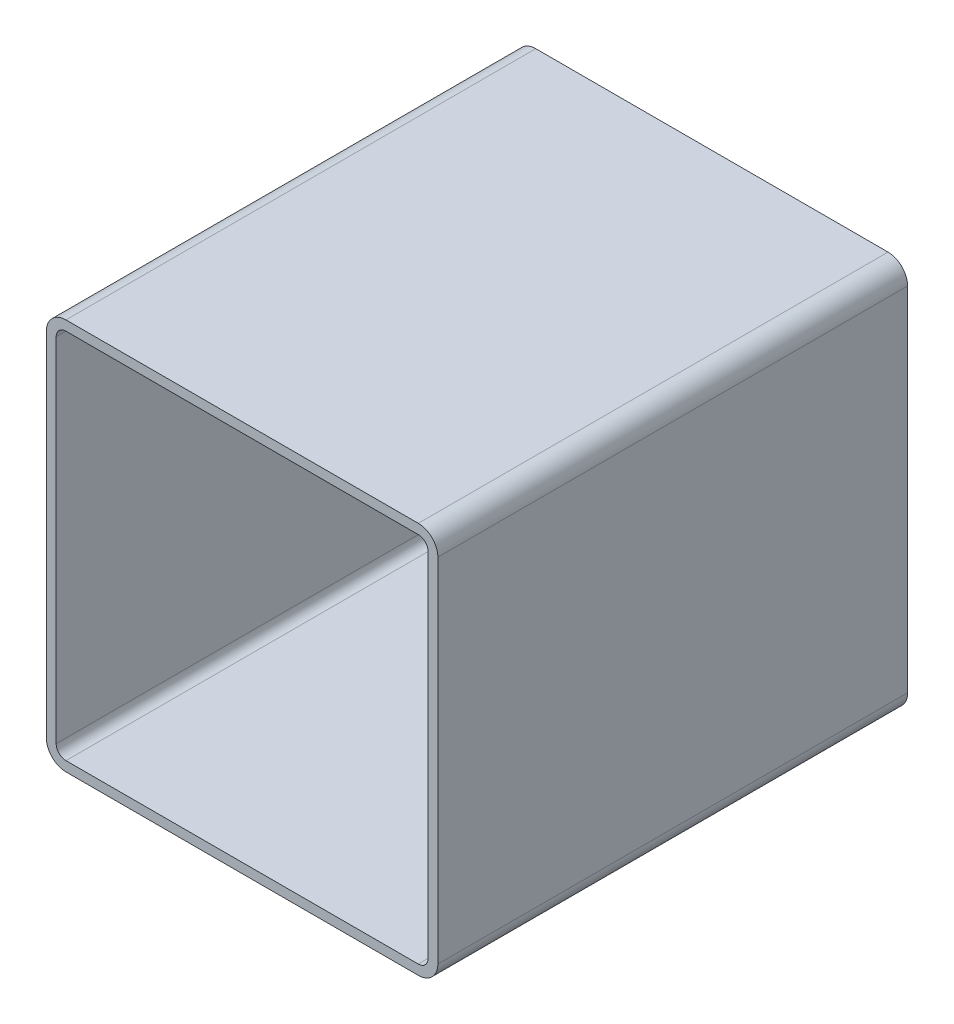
ISO-10303-21;
HEADER;
FILE_DESCRIPTION(('STEP AP214'),'2;1');
FILE_NAME('part.step','',(''),(''),'','','');
FILE_SCHEMA(('AUTOMOTIVE_DESIGN { 1 0 10303 214 1 1 1 1 }'));
ENDSEC;
DATA;
#1=APPLICATION_CONTEXT('core data for automotive mechanical design processes');
#2=APPLICATION_PROTOCOL_DEFINITION('international standard','automotive_design',2000,#1);
#3=PRODUCT_CONTEXT('',#1,'mechanical');
#4=PRODUCT('Part','Part','',(#3));
#5=PRODUCT_RELATED_PRODUCT_CATEGORY('part','',(#4));
#6=PRODUCT_DEFINITION_FORMATION('','',#4);
#7=PRODUCT_DEFINITION_CONTEXT('part definition',#1,'design');
#8=PRODUCT_DEFINITION('design','',#6,#7);
#9=PRODUCT_DEFINITION_SHAPE('','',#8);
#10=(LENGTH_UNIT() NAMED_UNIT(*) SI_UNIT(.MILLI.,.METRE.));
#11=(NAMED_UNIT(*) PLANE_ANGLE_UNIT() SI_UNIT($,.RADIAN.));
#12=(NAMED_UNIT(*) SI_UNIT($,.STERADIAN.) SOLID_ANGLE_UNIT());
#13=UNCERTAINTY_MEASURE_WITH_UNIT(LENGTH_MEASURE(1.E-05),#10,'distance_accuracy_value','');
#14=(GEOMETRIC_REPRESENTATION_CONTEXT(3) GLOBAL_UNCERTAINTY_ASSIGNED_CONTEXT((#13)) GLOBAL_UNIT_ASSIGNED_CONTEXT((#10,
#11,#12)) REPRESENTATION_CONTEXT('',''));
#15=CARTESIAN_POINT('',(0.,0.,0.));
#16=DIRECTION('',(0.,0.,1.));
#17=DIRECTION('',(1.,0.,0.));
#18=AXIS2_PLACEMENT_3D('',#15,#16,#17);
#19=CARTESIAN_POINT('',(15.4345794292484,243.220313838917,304.8));
#20=DIRECTION('',(0.,0.,1.));
#21=DIRECTION('',(1.,0.,0.));
#22=AXIS2_PLACEMENT_3D('',#19,#20,#21);
#23=PLANE('',#22);
#24=CARTESIAN_POINT('',(15.4345794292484,243.220313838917,304.8));
#25=DIRECTION('',(0.,0.,1.));
#26=DIRECTION('',(1.,0.,0.));
#27=AXIS2_PLACEMENT_3D('',#24,#25,#26);
#28=CIRCLE('',#27,12.7);
#29=CARTESIAN_POINT('',(15.4345794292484,255.920313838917,304.8));
#30=VERTEX_POINT('',#29);
#31=CARTESIAN_POINT('',(2.73457942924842,243.220313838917,304.8));
#32=VERTEX_POINT('',#31);
#33=EDGE_CURVE('E211',#30,#32,#28,.T.);
#34=ORIENTED_EDGE('',*,*,#33,.T.);
#35=DIRECTION('',(0.,-1.,0.));
#36=VECTOR('',#35,1.);
#37=CARTESIAN_POINT('',(2.73457942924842,14.6203138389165,304.8));
#38=LINE('',#37,#36);
#39=CARTESIAN_POINT('',(2.73457942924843,14.6203138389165,304.8));
#40=VERTEX_POINT('',#39);
#41=EDGE_CURVE('E214',#32,#40,#38,.T.);
#42=ORIENTED_EDGE('',*,*,#41,.T.);
#43=CARTESIAN_POINT('',(15.4345794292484,14.6203138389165,304.8));
#44=DIRECTION('',(0.,0.,1.));
#45=DIRECTION('',(1.,0.,0.));
#46=AXIS2_PLACEMENT_3D('',#43,#44,#45);
#47=CIRCLE('',#46,12.7);
#48=CARTESIAN_POINT('',(15.4345794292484,1.92031383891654,304.8));
#49=VERTEX_POINT('',#48);
#50=EDGE_CURVE('E217',#40,#49,#47,.T.);
#51=ORIENTED_EDGE('',*,*,#50,.T.);
#52=DIRECTION('',(1.,0.,0.));
#53=VECTOR('',#52,1.);
#54=CARTESIAN_POINT('',(244.034579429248,1.92031383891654,304.8));
#55=LINE('',#54,#53);
#56=CARTESIAN_POINT('',(244.034579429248,1.92031383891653,304.8));
#57=VERTEX_POINT('',#56);
#58=EDGE_CURVE('E219',#49,#57,#55,.T.);
#59=ORIENTED_EDGE('',*,*,#58,.T.);
#60=CARTESIAN_POINT('',(244.034579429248,14.6203138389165,304.8));
#61=DIRECTION('',(0.,0.,1.));
#62=DIRECTION('',(1.,0.,0.));
#63=AXIS2_PLACEMENT_3D('',#60,#61,#62);
#64=CIRCLE('',#63,12.7);
#65=CARTESIAN_POINT('',(256.734579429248,14.6203138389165,304.8));
#66=VERTEX_POINT('',#65);
#67=EDGE_CURVE('E221',#57,#66,#64,.T.);
#68=ORIENTED_EDGE('',*,*,#67,.T.);
#69=DIRECTION('',(0.,1.,0.));
#70=VECTOR('',#69,1.);
#71=CARTESIAN_POINT('',(256.734579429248,243.220313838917,304.8));
#72=LINE('',#71,#70);
#73=CARTESIAN_POINT('',(256.734579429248,243.220313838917,304.8));
#74=VERTEX_POINT('',#73);
#75=EDGE_CURVE('E223',#66,#74,#72,.T.);
#76=ORIENTED_EDGE('',*,*,#75,.T.);
#77=CARTESIAN_POINT('',(244.034579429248,243.220313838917,304.8));
#78=DIRECTION('',(0.,0.,1.));
#79=DIRECTION('',(1.,0.,0.));
#80=AXIS2_PLACEMENT_3D('',#77,#78,#79);
#81=CIRCLE('',#80,12.7);
#82=CARTESIAN_POINT('',(244.034579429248,255.920313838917,304.8));
#83=VERTEX_POINT('',#82);
#84=EDGE_CURVE('E225',#74,#83,#81,.T.);
#85=ORIENTED_EDGE('',*,*,#84,.T.);
#86=DIRECTION('',(-1.,0.,0.));
#87=VECTOR('',#86,1.);
#88=CARTESIAN_POINT('',(15.4345794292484,255.920313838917,304.8));
#89=LINE('',#88,#87);
#90=EDGE_CURVE('E227',#83,#30,#89,.T.);
#91=ORIENTED_EDGE('',*,*,#90,.T.);
#92=EDGE_LOOP('',(#34,#42,#51,#59,#68,#76,#85,#91));
#93=FACE_BOUND('',#92,.T.);
#94=DIRECTION('',(0.,-1.,0.));
#95=VECTOR('',#94,1.);
#96=CARTESIAN_POINT('',(9.08457942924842,14.6203138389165,304.8));
#97=LINE('',#96,#95);
#98=CARTESIAN_POINT('',(9.08457942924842,243.220313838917,304.8));
#99=VERTEX_POINT('',#98);
#100=CARTESIAN_POINT('',(9.08457942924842,14.6203138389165,304.8));
#101=VERTEX_POINT('',#100);
#102=EDGE_CURVE('E154',#99,#101,#97,.T.);
#103=ORIENTED_EDGE('',*,*,#102,.F.);
#104=CARTESIAN_POINT('',(15.4345794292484,243.220313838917,304.8));
#105=DIRECTION('',(0.,0.,1.));
#106=DIRECTION('',(1.,0.,0.));
#107=AXIS2_PLACEMENT_3D('',#104,#105,#106);
#108=CIRCLE('',#107,6.35000000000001);
#109=CARTESIAN_POINT('',(15.4345794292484,249.570313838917,304.8));
#110=VERTEX_POINT('',#109);
#111=EDGE_CURVE('E146',#110,#99,#108,.T.);
#112=ORIENTED_EDGE('',*,*,#111,.F.);
#113=DIRECTION('',(-1.,0.,0.));
#114=VECTOR('',#113,1.);
#115=CARTESIAN_POINT('',(15.4345794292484,249.570313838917,304.8));
#116=LINE('',#115,#114);
#117=CARTESIAN_POINT('',(244.034579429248,249.570313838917,304.8));
#118=VERTEX_POINT('',#117);
#119=EDGE_CURVE('E179',#118,#110,#116,.T.);
#120=ORIENTED_EDGE('',*,*,#119,.F.);
#121=CARTESIAN_POINT('',(244.034579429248,243.220313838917,304.8));
#122=DIRECTION('',(0.,0.,1.));
#123=DIRECTION('',(1.,0.,0.));
#124=AXIS2_PLACEMENT_3D('',#121,#122,#123);
#125=CIRCLE('',#124,6.35000000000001);
#126=CARTESIAN_POINT('',(250.384579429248,243.220313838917,304.8));
#127=VERTEX_POINT('',#126);
#128=EDGE_CURVE('E177',#127,#118,#125,.T.);
#129=ORIENTED_EDGE('',*,*,#128,.F.);
#130=DIRECTION('',(0.,1.,0.));
#131=VECTOR('',#130,1.);
#132=CARTESIAN_POINT('',(250.384579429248,243.220313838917,304.8));
#133=LINE('',#132,#131);
#134=CARTESIAN_POINT('',(250.384579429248,14.6203138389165,304.8));
#135=VERTEX_POINT('',#134);
#136=EDGE_CURVE('E175',#135,#127,#133,.T.);
#137=ORIENTED_EDGE('',*,*,#136,.F.);
#138=CARTESIAN_POINT('',(244.034579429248,14.6203138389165,304.8));
#139=DIRECTION('',(0.,0.,1.));
#140=DIRECTION('',(1.,0.,0.));
#141=AXIS2_PLACEMENT_3D('',#138,#139,#140);
#142=CIRCLE('',#141,6.35);
#143=CARTESIAN_POINT('',(244.034579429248,8.27031383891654,304.8));
#144=VERTEX_POINT('',#143);
#145=EDGE_CURVE('E173',#144,#135,#142,.T.);
#146=ORIENTED_EDGE('',*,*,#145,.F.);
#147=DIRECTION('',(1.,0.,0.));
#148=VECTOR('',#147,1.);
#149=CARTESIAN_POINT('',(244.034579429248,8.27031383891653,304.8));
#150=LINE('',#149,#148);
#151=CARTESIAN_POINT('',(15.4345794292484,8.27031383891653,304.8));
#152=VERTEX_POINT('',#151);
#153=EDGE_CURVE('E169',#152,#144,#150,.T.);
#154=ORIENTED_EDGE('',*,*,#153,.F.);
#155=CARTESIAN_POINT('',(15.4345794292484,14.6203138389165,304.8));
#156=DIRECTION('',(0.,0.,1.));
#157=DIRECTION('',(1.,0.,0.));
#158=AXIS2_PLACEMENT_3D('',#155,#156,#157);
#159=CIRCLE('',#158,6.35);
#160=EDGE_CURVE('E167',#101,#152,#159,.T.);
#161=ORIENTED_EDGE('',*,*,#160,.F.);
#162=EDGE_LOOP('',(#103,#112,#120,#129,#137,#146,#154,#161));
#163=FACE_BOUND('',#162,.T.);
#164=ADVANCED_FACE('F33',(#93,#163),#23,.T.);
#165=CARTESIAN_POINT('',(15.4345794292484,243.220313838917,0.));
#166=DIRECTION('',(0.,0.,1.));
#167=DIRECTION('',(1.,0.,0.));
#168=AXIS2_PLACEMENT_3D('',#165,#166,#167);
#169=PLANE('',#168);
#170=CARTESIAN_POINT('',(15.4345794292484,243.220313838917,0.));
#171=DIRECTION('',(0.,0.,1.));
#172=DIRECTION('',(1.,0.,0.));
#173=AXIS2_PLACEMENT_3D('',#170,#171,#172);
#174=CIRCLE('',#173,12.7);
#175=CARTESIAN_POINT('',(15.4345794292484,255.920313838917,0.));
#176=VERTEX_POINT('',#175);
#177=CARTESIAN_POINT('',(2.73457942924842,243.220313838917,0.));
#178=VERTEX_POINT('',#177);
#179=EDGE_CURVE('E162',#176,#178,#174,.T.);
#180=ORIENTED_EDGE('',*,*,#179,.F.);
#181=DIRECTION('',(-1.,0.,0.));
#182=VECTOR('',#181,1.);
#183=CARTESIAN_POINT('',(15.4345794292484,255.920313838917,0.));
#184=LINE('',#183,#182);
#185=CARTESIAN_POINT('',(244.034579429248,255.920313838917,0.));
#186=VERTEX_POINT('',#185);
#187=EDGE_CURVE('E215',#186,#176,#184,.T.);
#188=ORIENTED_EDGE('',*,*,#187,.F.);
#189=CARTESIAN_POINT('',(244.034579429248,243.220313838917,0.));
#190=DIRECTION('',(0.,0.,1.));
#191=DIRECTION('',(1.,0.,0.));
#192=AXIS2_PLACEMENT_3D('',#189,#190,#191);
#193=CIRCLE('',#192,12.7);
#194=CARTESIAN_POINT('',(256.734579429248,243.220313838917,0.));
#195=VERTEX_POINT('',#194);
#196=EDGE_CURVE('E242',#195,#186,#193,.T.);
#197=ORIENTED_EDGE('',*,*,#196,.F.);
#198=DIRECTION('',(0.,1.,0.));
#199=VECTOR('',#198,1.);
#200=CARTESIAN_POINT('',(256.734579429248,243.220313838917,0.));
#201=LINE('',#200,#199);
#202=CARTESIAN_POINT('',(256.734579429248,14.6203138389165,0.));
#203=VERTEX_POINT('',#202);
#204=EDGE_CURVE('E240',#203,#195,#201,.T.);
#205=ORIENTED_EDGE('',*,*,#204,.F.);
#206=CARTESIAN_POINT('',(244.034579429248,14.6203138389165,0.));
#207=DIRECTION('',(0.,0.,1.));
#208=DIRECTION('',(1.,0.,0.));
#209=AXIS2_PLACEMENT_3D('',#206,#207,#208);
#210=CIRCLE('',#209,12.7);
#211=CARTESIAN_POINT('',(244.034579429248,1.92031383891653,0.));
#212=VERTEX_POINT('',#211);
#213=EDGE_CURVE('E238',#212,#203,#210,.T.);
#214=ORIENTED_EDGE('',*,*,#213,.F.);
#215=DIRECTION('',(1.,0.,0.));
#216=VECTOR('',#215,1.);
#217=CARTESIAN_POINT('',(244.034579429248,1.92031383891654,0.));
#218=LINE('',#217,#216);
#219=CARTESIAN_POINT('',(15.4345794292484,1.92031383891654,0.));
#220=VERTEX_POINT('',#219);
#221=EDGE_CURVE('E236',#220,#212,#218,.T.);
#222=ORIENTED_EDGE('',*,*,#221,.F.);
#223=CARTESIAN_POINT('',(15.4345794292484,14.6203138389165,0.));
#224=DIRECTION('',(0.,0.,1.));
#225=DIRECTION('',(1.,0.,0.));
#226=AXIS2_PLACEMENT_3D('',#223,#224,#225);
#227=CIRCLE('',#226,12.7);
#228=CARTESIAN_POINT('',(2.73457942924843,14.6203138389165,0.));
#229=VERTEX_POINT('',#228);
#230=EDGE_CURVE('E234',#229,#220,#227,.T.);
#231=ORIENTED_EDGE('',*,*,#230,.F.);
#232=DIRECTION('',(0.,-1.,0.));
#233=VECTOR('',#232,1.);
#234=CARTESIAN_POINT('',(2.73457942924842,14.6203138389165,0.));
#235=LINE('',#234,#233);
#236=EDGE_CURVE('E232',#178,#229,#235,.T.);
#237=ORIENTED_EDGE('',*,*,#236,.F.);
#238=EDGE_LOOP('',(#180,#188,#197,#205,#214,#222,#231,#237));
#239=FACE_BOUND('',#238,.T.);
#240=CARTESIAN_POINT('',(15.4345794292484,243.220313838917,0.));
#241=DIRECTION('',(0.,0.,1.));
#242=DIRECTION('',(1.,0.,0.));
#243=AXIS2_PLACEMENT_3D('',#240,#241,#242);
#244=CIRCLE('',#243,6.35000000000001);
#245=CARTESIAN_POINT('',(15.4345794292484,249.570313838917,0.));
#246=VERTEX_POINT('',#245);
#247=CARTESIAN_POINT('',(9.08457942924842,243.220313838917,0.));
#248=VERTEX_POINT('',#247);
#249=EDGE_CURVE('E56',#246,#248,#244,.T.);
#250=ORIENTED_EDGE('',*,*,#249,.T.);
#251=DIRECTION('',(0.,-1.,0.));
#252=VECTOR('',#251,1.);
#253=CARTESIAN_POINT('',(9.08457942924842,14.6203138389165,0.));
#254=LINE('',#253,#252);
#255=CARTESIAN_POINT('',(9.08457942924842,14.6203138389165,0.));
#256=VERTEX_POINT('',#255);
#257=EDGE_CURVE('E161',#248,#256,#254,.T.);
#258=ORIENTED_EDGE('',*,*,#257,.T.);
#259=CARTESIAN_POINT('',(15.4345794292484,14.6203138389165,0.));
#260=DIRECTION('',(0.,0.,1.));
#261=DIRECTION('',(1.,0.,0.));
#262=AXIS2_PLACEMENT_3D('',#259,#260,#261);
#263=CIRCLE('',#262,6.35);
#264=CARTESIAN_POINT('',(15.4345794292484,8.27031383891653,0.));
#265=VERTEX_POINT('',#264);
#266=EDGE_CURVE('E183',#256,#265,#263,.T.);
#267=ORIENTED_EDGE('',*,*,#266,.T.);
#268=DIRECTION('',(1.,0.,0.));
#269=VECTOR('',#268,1.);
#270=CARTESIAN_POINT('',(244.034579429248,8.27031383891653,0.));
#271=LINE('',#270,#269);
#272=CARTESIAN_POINT('',(244.034579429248,8.27031383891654,0.));
#273=VERTEX_POINT('',#272);
#274=EDGE_CURVE('E186',#265,#273,#271,.T.);
#275=ORIENTED_EDGE('',*,*,#274,.T.);
#276=CARTESIAN_POINT('',(244.034579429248,14.6203138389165,0.));
#277=DIRECTION('',(0.,0.,1.));
#278=DIRECTION('',(1.,0.,0.));
#279=AXIS2_PLACEMENT_3D('',#276,#277,#278);
#280=CIRCLE('',#279,6.35);
#281=CARTESIAN_POINT('',(250.384579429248,14.6203138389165,0.));
#282=VERTEX_POINT('',#281);
#283=EDGE_CURVE('E189',#273,#282,#280,.T.);
#284=ORIENTED_EDGE('',*,*,#283,.T.);
#285=DIRECTION('',(0.,1.,0.));
#286=VECTOR('',#285,1.);
#287=CARTESIAN_POINT('',(250.384579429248,243.220313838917,0.));
#288=LINE('',#287,#286);
#289=CARTESIAN_POINT('',(250.384579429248,243.220313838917,0.));
#290=VERTEX_POINT('',#289);
#291=EDGE_CURVE('E192',#282,#290,#288,.T.);
#292=ORIENTED_EDGE('',*,*,#291,.T.);
#293=CARTESIAN_POINT('',(244.034579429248,243.220313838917,0.));
#294=DIRECTION('',(0.,0.,1.));
#295=DIRECTION('',(1.,0.,0.));
#296=AXIS2_PLACEMENT_3D('',#293,#294,#295);
#297=CIRCLE('',#296,6.35000000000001);
#298=CARTESIAN_POINT('',(244.034579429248,249.570313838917,0.));
#299=VERTEX_POINT('',#298);
#300=EDGE_CURVE('E195',#290,#299,#297,.T.);
#301=ORIENTED_EDGE('',*,*,#300,.T.);
#302=DIRECTION('',(-1.,0.,0.));
#303=VECTOR('',#302,1.);
#304=CARTESIAN_POINT('',(15.4345794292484,249.570313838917,0.));
#305=LINE('',#304,#303);
#306=EDGE_CURVE('E155',#299,#246,#305,.T.);
#307=ORIENTED_EDGE('',*,*,#306,.T.);
#308=EDGE_LOOP('',(#250,#258,#267,#275,#284,#292,#301,#307));
#309=FACE_BOUND('',#308,.T.);
#310=ADVANCED_FACE('F272',(#239,#309),#169,.F.);
#311=CARTESIAN_POINT('',(15.4345794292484,243.220313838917,304.8));
#312=DIRECTION('',(0.,0.,-1.));
#313=DIRECTION('',(-1.,0.,0.));
#314=AXIS2_PLACEMENT_3D('',#311,#312,#313);
#315=CYLINDRICAL_SURFACE('',#314,12.7);
#316=ORIENTED_EDGE('',*,*,#179,.T.);
#317=DIRECTION('',(0.,0.,-1.));
#318=VECTOR('',#317,1.);
#319=CARTESIAN_POINT('',(2.73457942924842,243.220313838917,304.8));
#320=LINE('',#319,#318);
#321=EDGE_CURVE('E11',#32,#178,#320,.T.);
#322=ORIENTED_EDGE('',*,*,#321,.F.);
#323=ORIENTED_EDGE('',*,*,#33,.F.);
#324=DIRECTION('',(0.,0.,-1.));
#325=VECTOR('',#324,1.);
#326=CARTESIAN_POINT('',(15.4345794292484,255.920313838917,304.8));
#327=LINE('',#326,#325);
#328=EDGE_CURVE('E229',#30,#176,#327,.T.);
#329=ORIENTED_EDGE('',*,*,#328,.T.);
#330=EDGE_LOOP('',(#316,#322,#323,#329));
#331=FACE_BOUND('',#330,.T.);
#332=ADVANCED_FACE('F35',(#331),#315,.T.);
#333=CARTESIAN_POINT('',(2.73457942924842,14.6203138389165,304.8));
#334=DIRECTION('',(1.,0.,0.));
#335=DIRECTION('',(0.,0.,-1.));
#336=AXIS2_PLACEMENT_3D('',#333,#334,#335);
#337=PLANE('',#336);
#338=ORIENTED_EDGE('',*,*,#236,.T.);
#339=DIRECTION('',(0.,0.,-1.));
#340=VECTOR('',#339,1.);
#341=CARTESIAN_POINT('',(2.73457942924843,14.6203138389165,304.8));
#342=LINE('',#341,#340);
#343=EDGE_CURVE('E41',#40,#229,#342,.T.);
#344=ORIENTED_EDGE('',*,*,#343,.F.);
#345=ORIENTED_EDGE('',*,*,#41,.F.);
#346=ORIENTED_EDGE('',*,*,#321,.T.);
#347=EDGE_LOOP('',(#338,#344,#345,#346));
#348=FACE_BOUND('',#347,.T.);
#349=ADVANCED_FACE('F289',(#348),#337,.F.);
#350=CARTESIAN_POINT('',(15.4345794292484,14.6203138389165,304.8));
#351=DIRECTION('',(0.,0.,-1.));
#352=DIRECTION('',(-1.,0.,0.));
#353=AXIS2_PLACEMENT_3D('',#350,#351,#352);
#354=CYLINDRICAL_SURFACE('',#353,12.7);
#355=ORIENTED_EDGE('',*,*,#230,.T.);
#356=DIRECTION('',(0.,0.,-1.));
#357=VECTOR('',#356,1.);
#358=CARTESIAN_POINT('',(15.4345794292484,1.92031383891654,304.8));
#359=LINE('',#358,#357);
#360=EDGE_CURVE('E259',#49,#220,#359,.T.);
#361=ORIENTED_EDGE('',*,*,#360,.F.);
#362=ORIENTED_EDGE('',*,*,#50,.F.);
#363=ORIENTED_EDGE('',*,*,#343,.T.);
#364=EDGE_LOOP('',(#355,#361,#362,#363));
#365=FACE_BOUND('',#364,.T.);
#366=ADVANCED_FACE('F266',(#365),#354,.T.);
#367=CARTESIAN_POINT('',(244.034579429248,1.92031383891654,304.8));
#368=DIRECTION('',(0.,1.,0.));
#369=DIRECTION('',(0.,0.,1.));
#370=AXIS2_PLACEMENT_3D('',#367,#368,#369);
#371=PLANE('',#370);
#372=ORIENTED_EDGE('',*,*,#221,.T.);
#373=DIRECTION('',(0.,0.,-1.));
#374=VECTOR('',#373,1.);
#375=CARTESIAN_POINT('',(244.034579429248,1.92031383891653,304.8));
#376=LINE('',#375,#374);
#377=EDGE_CURVE('E256',#57,#212,#376,.T.);
#378=ORIENTED_EDGE('',*,*,#377,.F.);
#379=ORIENTED_EDGE('',*,*,#58,.F.);
#380=ORIENTED_EDGE('',*,*,#360,.T.);
#381=EDGE_LOOP('',(#372,#378,#379,#380));
#382=FACE_BOUND('',#381,.T.);
#383=ADVANCED_FACE('F278',(#382),#371,.F.);
#384=CARTESIAN_POINT('',(244.034579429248,14.6203138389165,304.8));
#385=DIRECTION('',(0.,0.,-1.));
#386=DIRECTION('',(-1.,0.,0.));
#387=AXIS2_PLACEMENT_3D('',#384,#385,#386);
#388=CYLINDRICAL_SURFACE('',#387,12.7);
#389=ORIENTED_EDGE('',*,*,#213,.T.);
#390=DIRECTION('',(0.,0.,-1.));
#391=VECTOR('',#390,1.);
#392=CARTESIAN_POINT('',(256.734579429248,14.6203138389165,304.8));
#393=LINE('',#392,#391);
#394=EDGE_CURVE('E253',#66,#203,#393,.T.);
#395=ORIENTED_EDGE('',*,*,#394,.F.);
#396=ORIENTED_EDGE('',*,*,#67,.F.);
#397=ORIENTED_EDGE('',*,*,#377,.T.);
#398=EDGE_LOOP('',(#389,#395,#396,#397));
#399=FACE_BOUND('',#398,.T.);
#400=ADVANCED_FACE('F282',(#399),#388,.T.);
#401=CARTESIAN_POINT('',(256.734579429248,243.220313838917,304.8));
#402=DIRECTION('',(-1.,0.,0.));
#403=DIRECTION('',(0.,0.,1.));
#404=AXIS2_PLACEMENT_3D('',#401,#402,#403);
#405=PLANE('',#404);
#406=ORIENTED_EDGE('',*,*,#204,.T.);
#407=DIRECTION('',(0.,0.,-1.));
#408=VECTOR('',#407,1.);
#409=CARTESIAN_POINT('',(256.734579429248,243.220313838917,304.8));
#410=LINE('',#409,#408);
#411=EDGE_CURVE('E250',#74,#195,#410,.T.);
#412=ORIENTED_EDGE('',*,*,#411,.F.);
#413=ORIENTED_EDGE('',*,*,#75,.F.);
#414=ORIENTED_EDGE('',*,*,#394,.T.);
#415=EDGE_LOOP('',(#406,#412,#413,#414));
#416=FACE_BOUND('',#415,.T.);
#417=ADVANCED_FACE('F302',(#416),#405,.F.);
#418=CARTESIAN_POINT('',(244.034579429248,243.220313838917,304.8));
#419=DIRECTION('',(0.,0.,-1.));
#420=DIRECTION('',(-1.,0.,0.));
#421=AXIS2_PLACEMENT_3D('',#418,#419,#420);
#422=CYLINDRICAL_SURFACE('',#421,12.7);
#423=ORIENTED_EDGE('',*,*,#196,.T.);
#424=DIRECTION('',(0.,0.,-1.));
#425=VECTOR('',#424,1.);
#426=CARTESIAN_POINT('',(244.034579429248,255.920313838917,304.8));
#427=LINE('',#426,#425);
#428=EDGE_CURVE('E247',#83,#186,#427,.T.);
#429=ORIENTED_EDGE('',*,*,#428,.F.);
#430=ORIENTED_EDGE('',*,*,#84,.F.);
#431=ORIENTED_EDGE('',*,*,#411,.T.);
#432=EDGE_LOOP('',(#423,#429,#430,#431));
#433=FACE_BOUND('',#432,.T.);
#434=ADVANCED_FACE('F300',(#433),#422,.T.);
#435=CARTESIAN_POINT('',(15.4345794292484,255.920313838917,304.8));
#436=DIRECTION('',(0.,-1.,0.));
#437=DIRECTION('',(0.,0.,-1.));
#438=AXIS2_PLACEMENT_3D('',#435,#436,#437);
#439=PLANE('',#438);
#440=ORIENTED_EDGE('',*,*,#187,.T.);
#441=ORIENTED_EDGE('',*,*,#328,.F.);
#442=ORIENTED_EDGE('',*,*,#90,.F.);
#443=ORIENTED_EDGE('',*,*,#428,.T.);
#444=EDGE_LOOP('',(#440,#441,#442,#443));
#445=FACE_BOUND('',#444,.T.);
#446=ADVANCED_FACE('F295',(#445),#439,.F.);
#447=CARTESIAN_POINT('',(15.4345794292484,243.220313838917,304.8));
#448=DIRECTION('',(0.,0.,-1.));
#449=DIRECTION('',(-1.,0.,0.));
#450=AXIS2_PLACEMENT_3D('',#447,#448,#449);
#451=CYLINDRICAL_SURFACE('',#450,6.35000000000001);
#452=ORIENTED_EDGE('',*,*,#249,.F.);
#453=DIRECTION('',(0.,0.,-1.));
#454=VECTOR('',#453,1.);
#455=CARTESIAN_POINT('',(15.4345794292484,249.570313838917,304.8));
#456=LINE('',#455,#454);
#457=EDGE_CURVE('E150',#110,#246,#456,.T.);
#458=ORIENTED_EDGE('',*,*,#457,.F.);
#459=ORIENTED_EDGE('',*,*,#111,.T.);
#460=DIRECTION('',(0.,0.,-1.));
#461=VECTOR('',#460,1.);
#462=CARTESIAN_POINT('',(9.08457942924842,243.220313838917,304.8));
#463=LINE('',#462,#461);
#464=EDGE_CURVE('E149',#99,#248,#463,.T.);
#465=ORIENTED_EDGE('',*,*,#464,.T.);
#466=EDGE_LOOP('',(#452,#458,#459,#465));
#467=FACE_BOUND('',#466,.T.);
#468=ADVANCED_FACE('F148',(#467),#451,.F.);
#469=CARTESIAN_POINT('',(9.08457942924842,14.6203138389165,304.8));
#470=DIRECTION('',(1.,0.,0.));
#471=DIRECTION('',(0.,0.,-1.));
#472=AXIS2_PLACEMENT_3D('',#469,#470,#471);
#473=PLANE('',#472);
#474=ORIENTED_EDGE('',*,*,#257,.F.);
#475=ORIENTED_EDGE('',*,*,#464,.F.);
#476=ORIENTED_EDGE('',*,*,#102,.T.);
#477=DIRECTION('',(0.,0.,-1.));
#478=VECTOR('',#477,1.);
#479=CARTESIAN_POINT('',(9.08457942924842,14.6203138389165,304.8));
#480=LINE('',#479,#478);
#481=EDGE_CURVE('E163',#101,#256,#480,.T.);
#482=ORIENTED_EDGE('',*,*,#481,.T.);
#483=EDGE_LOOP('',(#474,#475,#476,#482));
#484=FACE_BOUND('',#483,.T.);
#485=ADVANCED_FACE('F158',(#484),#473,.T.);
#486=CARTESIAN_POINT('',(15.4345794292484,14.6203138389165,304.8));
#487=DIRECTION('',(0.,0.,-1.));
#488=DIRECTION('',(-1.,0.,0.));
#489=AXIS2_PLACEMENT_3D('',#486,#487,#488);
#490=CYLINDRICAL_SURFACE('',#489,6.35);
#491=ORIENTED_EDGE('',*,*,#266,.F.);
#492=ORIENTED_EDGE('',*,*,#481,.F.);
#493=ORIENTED_EDGE('',*,*,#160,.T.);
#494=DIRECTION('',(0.,0.,-1.));
#495=VECTOR('',#494,1.);
#496=CARTESIAN_POINT('',(15.4345794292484,8.27031383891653,304.8));
#497=LINE('',#496,#495);
#498=EDGE_CURVE('E208',#152,#265,#497,.T.);
#499=ORIENTED_EDGE('',*,*,#498,.T.);
#500=EDGE_LOOP('',(#491,#492,#493,#499));
#501=FACE_BOUND('',#500,.T.);
#502=ADVANCED_FACE('F327',(#501),#490,.F.);
#503=CARTESIAN_POINT('',(244.034579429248,8.27031383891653,304.8));
#504=DIRECTION('',(0.,1.,0.));
#505=DIRECTION('',(0.,0.,1.));
#506=AXIS2_PLACEMENT_3D('',#503,#504,#505);
#507=PLANE('',#506);
#508=ORIENTED_EDGE('',*,*,#274,.F.);
#509=ORIENTED_EDGE('',*,*,#498,.F.);
#510=ORIENTED_EDGE('',*,*,#153,.T.);
#511=DIRECTION('',(0.,0.,-1.));
#512=VECTOR('',#511,1.);
#513=CARTESIAN_POINT('',(244.034579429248,8.27031383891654,304.8));
#514=LINE('',#513,#512);
#515=EDGE_CURVE('E206',#144,#273,#514,.T.);
#516=ORIENTED_EDGE('',*,*,#515,.T.);
#517=EDGE_LOOP('',(#508,#509,#510,#516));
#518=FACE_BOUND('',#517,.T.);
#519=ADVANCED_FACE('F331',(#518),#507,.T.);
#520=CARTESIAN_POINT('',(244.034579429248,14.6203138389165,304.8));
#521=DIRECTION('',(0.,0.,-1.));
#522=DIRECTION('',(-1.,0.,0.));
#523=AXIS2_PLACEMENT_3D('',#520,#521,#522);
#524=CYLINDRICAL_SURFACE('',#523,6.35);
#525=ORIENTED_EDGE('',*,*,#283,.F.);
#526=ORIENTED_EDGE('',*,*,#515,.F.);
#527=ORIENTED_EDGE('',*,*,#145,.T.);
#528=DIRECTION('',(0.,0.,-1.));
#529=VECTOR('',#528,1.);
#530=CARTESIAN_POINT('',(250.384579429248,14.6203138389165,304.8));
#531=LINE('',#530,#529);
#532=EDGE_CURVE('E204',#135,#282,#531,.T.);
#533=ORIENTED_EDGE('',*,*,#532,.T.);
#534=EDGE_LOOP('',(#525,#526,#527,#533));
#535=FACE_BOUND('',#534,.T.);
#536=ADVANCED_FACE('F337',(#535),#524,.F.);
#537=CARTESIAN_POINT('',(250.384579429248,243.220313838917,304.8));
#538=DIRECTION('',(-1.,0.,0.));
#539=DIRECTION('',(0.,0.,1.));
#540=AXIS2_PLACEMENT_3D('',#537,#538,#539);
#541=PLANE('',#540);
#542=ORIENTED_EDGE('',*,*,#291,.F.);
#543=ORIENTED_EDGE('',*,*,#532,.F.);
#544=ORIENTED_EDGE('',*,*,#136,.T.);
#545=DIRECTION('',(0.,0.,-1.));
#546=VECTOR('',#545,1.);
#547=CARTESIAN_POINT('',(250.384579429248,243.220313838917,304.8));
#548=LINE('',#547,#546);
#549=EDGE_CURVE('E202',#127,#290,#548,.T.);
#550=ORIENTED_EDGE('',*,*,#549,.T.);
#551=EDGE_LOOP('',(#542,#543,#544,#550));
#552=FACE_BOUND('',#551,.T.);
#553=ADVANCED_FACE('F341',(#552),#541,.T.);
#554=CARTESIAN_POINT('',(244.034579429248,243.220313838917,304.8));
#555=DIRECTION('',(0.,0.,-1.));
#556=DIRECTION('',(-1.,0.,0.));
#557=AXIS2_PLACEMENT_3D('',#554,#555,#556);
#558=CYLINDRICAL_SURFACE('',#557,6.35000000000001);
#559=ORIENTED_EDGE('',*,*,#300,.F.);
#560=ORIENTED_EDGE('',*,*,#549,.F.);
#561=ORIENTED_EDGE('',*,*,#128,.T.);
#562=DIRECTION('',(0.,0.,-1.));
#563=VECTOR('',#562,1.);
#564=CARTESIAN_POINT('',(244.034579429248,249.570313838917,304.8));
#565=LINE('',#564,#563);
#566=EDGE_CURVE('E48',#118,#299,#565,.T.);
#567=ORIENTED_EDGE('',*,*,#566,.T.);
#568=EDGE_LOOP('',(#559,#560,#561,#567));
#569=FACE_BOUND('',#568,.T.);
#570=ADVANCED_FACE('F345',(#569),#558,.F.);
#571=CARTESIAN_POINT('',(15.4345794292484,249.570313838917,304.8));
#572=DIRECTION('',(0.,-1.,0.));
#573=DIRECTION('',(0.,0.,-1.));
#574=AXIS2_PLACEMENT_3D('',#571,#572,#573);
#575=PLANE('',#574);
#576=ORIENTED_EDGE('',*,*,#306,.F.);
#577=ORIENTED_EDGE('',*,*,#566,.F.);
#578=ORIENTED_EDGE('',*,*,#119,.T.);
#579=ORIENTED_EDGE('',*,*,#457,.T.);
#580=EDGE_LOOP('',(#576,#577,#578,#579));
#581=FACE_BOUND('',#580,.T.);
#582=ADVANCED_FACE('F349',(#581),#575,.T.);
#583=CLOSED_SHELL('',(#164,#310,#332,#349,#366,#383,#400,#417,#434,#446,#468,#485,#502,#519,
#536,#553,#570,#582));
#584=MANIFOLD_SOLID_BREP('B2',#583);
#585=ADVANCED_BREP_SHAPE_REPRESENTATION('',(#18,#584),#14);
#586=SHAPE_DEFINITION_REPRESENTATION(#9,#585);
ENDSEC;
END-ISO-10303-21;
